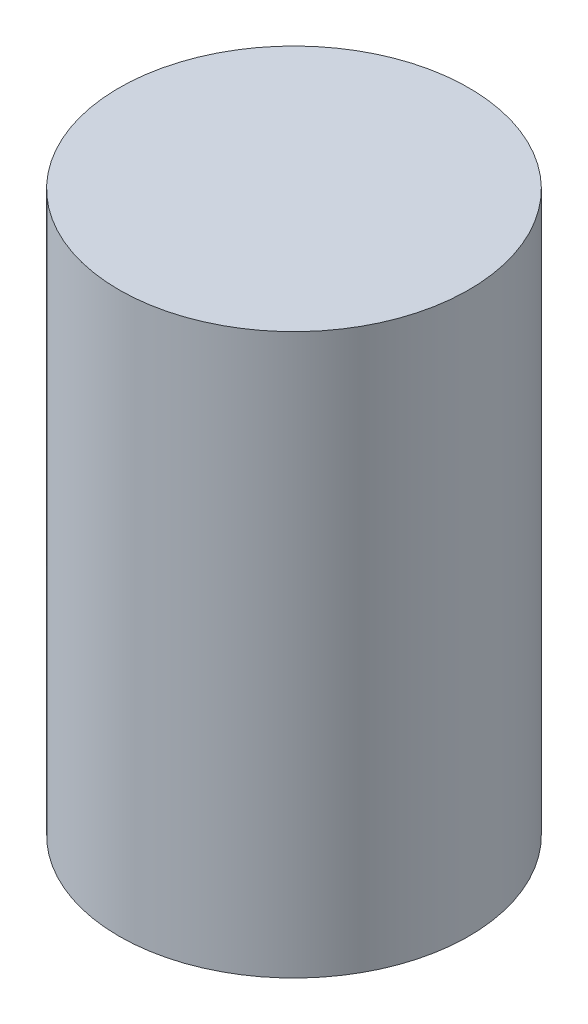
ISO-10303-21;
HEADER;
FILE_DESCRIPTION(('STEP AP214'),'2;1');
FILE_NAME('part.step','',(''),(''),'','','');
FILE_SCHEMA(('AUTOMOTIVE_DESIGN { 1 0 10303 214 1 1 1 1 }'));
ENDSEC;
DATA;
#1=APPLICATION_CONTEXT('core data for automotive mechanical design processes');
#2=APPLICATION_PROTOCOL_DEFINITION('international standard','automotive_design',2000,#1);
#3=PRODUCT_CONTEXT('',#1,'mechanical');
#4=PRODUCT('Part','Part','',(#3));
#5=PRODUCT_RELATED_PRODUCT_CATEGORY('part','',(#4));
#6=PRODUCT_DEFINITION_FORMATION('','',#4);
#7=PRODUCT_DEFINITION_CONTEXT('part definition',#1,'design');
#8=PRODUCT_DEFINITION('design','',#6,#7);
#9=PRODUCT_DEFINITION_SHAPE('','',#8);
#10=(LENGTH_UNIT() NAMED_UNIT(*) SI_UNIT(.MILLI.,.METRE.));
#11=(NAMED_UNIT(*) PLANE_ANGLE_UNIT() SI_UNIT($,.RADIAN.));
#12=(NAMED_UNIT(*) SI_UNIT($,.STERADIAN.) SOLID_ANGLE_UNIT());
#13=UNCERTAINTY_MEASURE_WITH_UNIT(LENGTH_MEASURE(1.E-05),#10,'distance_accuracy_value','');
#14=(GEOMETRIC_REPRESENTATION_CONTEXT(3) GLOBAL_UNCERTAINTY_ASSIGNED_CONTEXT((#13)) GLOBAL_UNIT_ASSIGNED_CONTEXT((#10,
#11,#12)) REPRESENTATION_CONTEXT('',''));
#15=CARTESIAN_POINT('',(0.,0.,0.));
#16=DIRECTION('',(0.,0.,1.));
#17=DIRECTION('',(1.,0.,0.));
#18=AXIS2_PLACEMENT_3D('',#15,#16,#17);
#19=CARTESIAN_POINT('',(0.,37.5,0.));
#20=DIRECTION('',(0.,1.,0.));
#21=DIRECTION('',(0.,0.,1.));
#22=AXIS2_PLACEMENT_3D('',#19,#20,#21);
#23=CYLINDRICAL_SURFACE('',#22,12.5000701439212);
#24=CARTESIAN_POINT('',(0.,-2.5,0.));
#25=DIRECTION('',(0.,1.,0.));
#26=DIRECTION('',(0.,0.,1.));
#27=AXIS2_PLACEMENT_3D('',#24,#25,#26);
#28=CIRCLE('',#27,12.5000701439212);
#29=CARTESIAN_POINT('',(0.,-2.5,12.5000701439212));
#30=VERTEX_POINT('',#29);
#31=EDGE_CURVE('E10',#30,#30,#28,.T.);
#32=ORIENTED_EDGE('',*,*,#31,.T.);
#33=EDGE_LOOP('',(#32));
#34=FACE_BOUND('',#33,.T.);
#35=CARTESIAN_POINT('',(0.,37.5,0.));
#36=DIRECTION('',(0.,1.,0.));
#37=DIRECTION('',(0.,0.,1.));
#38=AXIS2_PLACEMENT_3D('',#35,#36,#37);
#39=CIRCLE('',#38,12.5000701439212);
#40=CARTESIAN_POINT('',(0.,37.5,12.5000701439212));
#41=VERTEX_POINT('',#40);
#42=EDGE_CURVE('E44',#41,#41,#39,.T.);
#43=ORIENTED_EDGE('',*,*,#42,.F.);
#44=EDGE_LOOP('',(#43));
#45=FACE_BOUND('',#44,.T.);
#46=ADVANCED_FACE('F30',(#34,#45),#23,.T.);
#47=CARTESIAN_POINT('',(-12.5000701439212,-2.5,0.));
#48=DIRECTION('',(0.,-1.,0.));
#49=DIRECTION('',(0.,0.,-1.));
#50=AXIS2_PLACEMENT_3D('',#47,#48,#49);
#51=PLANE('',#50);
#52=CARTESIAN_POINT('',(0.,-2.5,0.));
#53=DIRECTION('',(0.,1.,0.));
#54=DIRECTION('',(0.,0.,1.));
#55=AXIS2_PLACEMENT_3D('',#52,#53,#54);
#56=CIRCLE('',#55,9.28410785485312);
#57=CARTESIAN_POINT('',(0.,-2.5,9.28410785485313));
#58=VERTEX_POINT('',#57);
#59=EDGE_CURVE('E36',#58,#58,#56,.T.);
#60=ORIENTED_EDGE('',*,*,#59,.T.);
#61=EDGE_LOOP('',(#60));
#62=FACE_BOUND('',#61,.T.);
#63=ORIENTED_EDGE('',*,*,#31,.F.);
#64=EDGE_LOOP('',(#63));
#65=FACE_BOUND('',#64,.T.);
#66=ADVANCED_FACE('F53',(#62,#65),#51,.T.);
#67=CARTESIAN_POINT('',(0.,-2.5,0.));
#68=DIRECTION('',(0.,-1.,0.));
#69=DIRECTION('',(0.,0.,-1.));
#70=AXIS2_PLACEMENT_3D('',#67,#68,#69);
#71=CONICAL_SURFACE('',#70,9.28410785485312,0.41301843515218);
#72=CARTESIAN_POINT('',(0.,3.01031833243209,0.));
#73=DIRECTION('',(0.,1.,0.));
#74=DIRECTION('',(0.,0.,1.));
#75=AXIS2_PLACEMENT_3D('',#72,#73,#74);
#76=CIRCLE('',#75,6.86935102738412);
#77=CARTESIAN_POINT('',(0.,3.01031833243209,6.86935102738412));
#78=VERTEX_POINT('',#77);
#79=EDGE_CURVE('E40',#78,#78,#76,.T.);
#80=ORIENTED_EDGE('',*,*,#79,.T.);
#81=EDGE_LOOP('',(#80));
#82=FACE_BOUND('',#81,.T.);
#83=ORIENTED_EDGE('',*,*,#59,.F.);
#84=EDGE_LOOP('',(#83));
#85=FACE_BOUND('',#84,.T.);
#86=ADVANCED_FACE('F57',(#82,#85),#71,.F.);
#87=CARTESIAN_POINT('',(0.,0.,0.));
#88=DIRECTION('',(0.,1.,0.));
#89=DIRECTION('',(-1.,0.,0.));
#90=AXIS2_PLACEMENT_3D('',#87,#88,#89);
#91=SPHERICAL_SURFACE('',#90,7.5);
#92=ORIENTED_EDGE('',*,*,#79,.F.);
#93=EDGE_LOOP('',(#92));
#94=FACE_BOUND('',#93,.T.);
#95=ADVANCED_FACE('F61',(#94),#91,.F.);
#96=CARTESIAN_POINT('',(-12.5000701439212,37.5,0.));
#97=DIRECTION('',(0.,1.,0.));
#98=DIRECTION('',(0.,0.,1.));
#99=AXIS2_PLACEMENT_3D('',#96,#97,#98);
#100=PLANE('',#99);
#101=ORIENTED_EDGE('',*,*,#42,.T.);
#102=EDGE_LOOP('',(#101));
#103=FACE_BOUND('',#102,.T.);
#104=ADVANCED_FACE('F50',(#103),#100,.T.);
#105=CLOSED_SHELL('',(#46,#66,#86,#95,#104));
#106=MANIFOLD_SOLID_BREP('B2',#105);
#107=ADVANCED_BREP_SHAPE_REPRESENTATION('',(#18,#106),#14);
#108=SHAPE_DEFINITION_REPRESENTATION(#9,#107);
ENDSEC;
END-ISO-10303-21;
